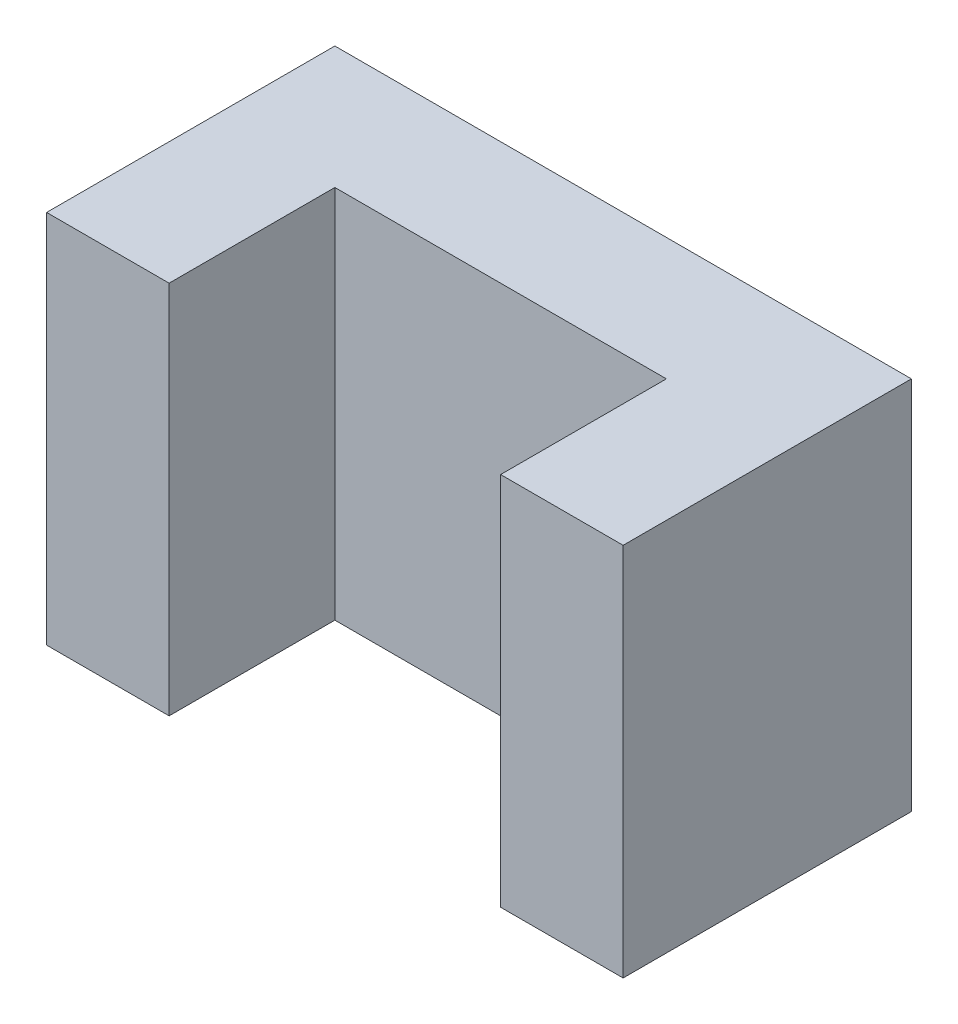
ISO-10303-21;
HEADER;
FILE_DESCRIPTION(('STEP AP214'),'2;1');
FILE_NAME('part.step','',(''),(''),'','','');
FILE_SCHEMA(('AUTOMOTIVE_DESIGN { 1 0 10303 214 1 1 1 1 }'));
ENDSEC;
DATA;
#1=APPLICATION_CONTEXT('core data for automotive mechanical design processes');
#2=APPLICATION_PROTOCOL_DEFINITION('international standard','automotive_design',2000,#1);
#3=PRODUCT_CONTEXT('',#1,'mechanical');
#4=PRODUCT('Part','Part','',(#3));
#5=PRODUCT_RELATED_PRODUCT_CATEGORY('part','',(#4));
#6=PRODUCT_DEFINITION_FORMATION('','',#4);
#7=PRODUCT_DEFINITION_CONTEXT('part definition',#1,'design');
#8=PRODUCT_DEFINITION('design','',#6,#7);
#9=PRODUCT_DEFINITION_SHAPE('','',#8);
#10=(LENGTH_UNIT() NAMED_UNIT(*) SI_UNIT(.MILLI.,.METRE.));
#11=(NAMED_UNIT(*) PLANE_ANGLE_UNIT() SI_UNIT($,.RADIAN.));
#12=(NAMED_UNIT(*) SI_UNIT($,.STERADIAN.) SOLID_ANGLE_UNIT());
#13=UNCERTAINTY_MEASURE_WITH_UNIT(LENGTH_MEASURE(1.E-05),#10,'distance_accuracy_value','');
#14=(GEOMETRIC_REPRESENTATION_CONTEXT(3) GLOBAL_UNCERTAINTY_ASSIGNED_CONTEXT((#13)) GLOBAL_UNIT_ASSIGNED_CONTEXT((#10,
#11,#12)) REPRESENTATION_CONTEXT('',''));
#15=CARTESIAN_POINT('',(0.,0.,0.));
#16=DIRECTION('',(0.,0.,1.));
#17=DIRECTION('',(1.,0.,0.));
#18=AXIS2_PLACEMENT_3D('',#15,#16,#17);
#19=CARTESIAN_POINT('',(-75.4783031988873,0.733936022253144,-20.));
#20=DIRECTION('',(0.,1.,0.));
#21=DIRECTION('',(0.,0.,1.));
#22=AXIS2_PLACEMENT_3D('',#19,#20,#21);
#23=PLANE('',#22);
#24=DIRECTION('',(0.,0.,1.));
#25=VECTOR('',#24,1.);
#26=CARTESIAN_POINT('',(-66.9783031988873,0.733936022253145,-11.5));
#27=LINE('',#26,#25);
#28=CARTESIAN_POINT('',(-66.9783031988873,0.733936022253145,-11.5));
#29=VERTEX_POINT('',#28);
#30=CARTESIAN_POINT('',(-66.9783031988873,0.733936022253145,0.));
#31=VERTEX_POINT('',#30);
#32=EDGE_CURVE('E197',#29,#31,#27,.T.);
#33=ORIENTED_EDGE('',*,*,#32,.F.);
#34=DIRECTION('',(-1.,0.,0.));
#35=VECTOR('',#34,1.);
#36=CARTESIAN_POINT('',(-66.9783031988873,0.733936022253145,-11.5));
#37=LINE('',#36,#35);
#38=CARTESIAN_POINT('',(-43.9783031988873,0.733936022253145,-11.5));
#39=VERTEX_POINT('',#38);
#40=EDGE_CURVE('E132',#39,#29,#37,.T.);
#41=ORIENTED_EDGE('',*,*,#40,.F.);
#42=DIRECTION('',(0.,0.,1.));
#43=VECTOR('',#42,1.);
#44=CARTESIAN_POINT('',(-43.9783031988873,0.733936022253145,-11.5));
#45=LINE('',#44,#43);
#46=CARTESIAN_POINT('',(-43.9783031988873,0.733936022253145,0.));
#47=VERTEX_POINT('',#46);
#48=EDGE_CURVE('E213',#39,#47,#45,.T.);
#49=ORIENTED_EDGE('',*,*,#48,.T.);
#50=DIRECTION('',(-1.,0.,0.));
#51=VECTOR('',#50,1.);
#52=CARTESIAN_POINT('',(-75.4783031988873,0.733936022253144,0.));
#53=LINE('',#52,#51);
#54=CARTESIAN_POINT('',(-35.4783031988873,0.733936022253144,0.));
#55=VERTEX_POINT('',#54);
#56=EDGE_CURVE('E165',#55,#47,#53,.T.);
#57=ORIENTED_EDGE('',*,*,#56,.F.);
#58=DIRECTION('',(0.,0.,1.));
#59=VECTOR('',#58,1.);
#60=CARTESIAN_POINT('',(-35.4783031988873,0.733936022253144,-20.));
#61=LINE('',#60,#59);
#62=CARTESIAN_POINT('',(-35.4783031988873,0.733936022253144,-20.));
#63=VERTEX_POINT('',#62);
#64=EDGE_CURVE('E57',#63,#55,#61,.T.);
#65=ORIENTED_EDGE('',*,*,#64,.F.);
#66=DIRECTION('',(-1.,0.,0.));
#67=VECTOR('',#66,1.);
#68=CARTESIAN_POINT('',(-75.4783031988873,0.733936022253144,-20.));
#69=LINE('',#68,#67);
#70=CARTESIAN_POINT('',(-75.4783031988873,0.733936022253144,-20.));
#71=VERTEX_POINT('',#70);
#72=EDGE_CURVE('E181',#63,#71,#69,.T.);
#73=ORIENTED_EDGE('',*,*,#72,.T.);
#74=DIRECTION('',(0.,0.,1.));
#75=VECTOR('',#74,1.);
#76=CARTESIAN_POINT('',(-75.4783031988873,0.733936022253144,-20.));
#77=LINE('',#76,#75);
#78=CARTESIAN_POINT('',(-75.4783031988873,0.733936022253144,0.));
#79=VERTEX_POINT('',#78);
#80=EDGE_CURVE('E12',#71,#79,#77,.T.);
#81=ORIENTED_EDGE('',*,*,#80,.T.);
#82=EDGE_CURVE('E95',#31,#79,#53,.T.);
#83=ORIENTED_EDGE('',*,*,#82,.F.);
#84=EDGE_LOOP('',(#33,#41,#49,#57,#65,#73,#81,#83));
#85=FACE_BOUND('',#84,.T.);
#86=ADVANCED_FACE('F47',(#85),#23,.T.);
#87=CARTESIAN_POINT('',(-75.4783031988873,-25.2660639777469,-20.));
#88=DIRECTION('',(0.,-1.,0.));
#89=DIRECTION('',(0.,0.,-1.));
#90=AXIS2_PLACEMENT_3D('',#87,#88,#89);
#91=PLANE('',#90);
#92=DIRECTION('',(0.,0.,1.));
#93=VECTOR('',#92,1.);
#94=CARTESIAN_POINT('',(-66.9783031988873,-25.2660639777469,-11.5));
#95=LINE('',#94,#93);
#96=CARTESIAN_POINT('',(-66.9783031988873,-25.2660639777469,-11.5));
#97=VERTEX_POINT('',#96);
#98=CARTESIAN_POINT('',(-66.9783031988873,-25.2660639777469,0.));
#99=VERTEX_POINT('',#98);
#100=EDGE_CURVE('E123',#97,#99,#95,.T.);
#101=ORIENTED_EDGE('',*,*,#100,.T.);
#102=DIRECTION('',(1.,0.,0.));
#103=VECTOR('',#102,1.);
#104=CARTESIAN_POINT('',(-75.4783031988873,-25.2660639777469,0.));
#105=LINE('',#104,#103);
#106=CARTESIAN_POINT('',(-75.4783031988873,-25.2660639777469,0.));
#107=VERTEX_POINT('',#106);
#108=EDGE_CURVE('E198',#107,#99,#105,.T.);
#109=ORIENTED_EDGE('',*,*,#108,.F.);
#110=DIRECTION('',(0.,0.,1.));
#111=VECTOR('',#110,1.);
#112=CARTESIAN_POINT('',(-75.4783031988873,-25.2660639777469,-20.));
#113=LINE('',#112,#111);
#114=CARTESIAN_POINT('',(-75.4783031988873,-25.2660639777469,-20.));
#115=VERTEX_POINT('',#114);
#116=EDGE_CURVE('E51',#115,#107,#113,.T.);
#117=ORIENTED_EDGE('',*,*,#116,.F.);
#118=DIRECTION('',(1.,0.,0.));
#119=VECTOR('',#118,1.);
#120=CARTESIAN_POINT('',(-75.4783031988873,-25.2660639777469,-20.));
#121=LINE('',#120,#119);
#122=CARTESIAN_POINT('',(-35.4783031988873,-25.2660639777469,-20.));
#123=VERTEX_POINT('',#122);
#124=EDGE_CURVE('E190',#115,#123,#121,.T.);
#125=ORIENTED_EDGE('',*,*,#124,.T.);
#126=DIRECTION('',(0.,0.,1.));
#127=VECTOR('',#126,1.);
#128=CARTESIAN_POINT('',(-35.4783031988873,-25.2660639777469,-20.));
#129=LINE('',#128,#127);
#130=CARTESIAN_POINT('',(-35.4783031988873,-25.2660639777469,0.));
#131=VERTEX_POINT('',#130);
#132=EDGE_CURVE('E176',#123,#131,#129,.T.);
#133=ORIENTED_EDGE('',*,*,#132,.T.);
#134=CARTESIAN_POINT('',(-43.9783031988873,-25.2660639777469,0.));
#135=VERTEX_POINT('',#134);
#136=EDGE_CURVE('E196',#135,#131,#105,.T.);
#137=ORIENTED_EDGE('',*,*,#136,.F.);
#138=DIRECTION('',(0.,0.,1.));
#139=VECTOR('',#138,1.);
#140=CARTESIAN_POINT('',(-43.9783031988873,-25.2660639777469,-11.5));
#141=LINE('',#140,#139);
#142=CARTESIAN_POINT('',(-43.9783031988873,-25.2660639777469,-11.5));
#143=VERTEX_POINT('',#142);
#144=EDGE_CURVE('E65',#143,#135,#141,.T.);
#145=ORIENTED_EDGE('',*,*,#144,.F.);
#146=DIRECTION('',(1.,0.,0.));
#147=VECTOR('',#146,1.);
#148=CARTESIAN_POINT('',(-66.9783031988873,-25.2660639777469,-11.5));
#149=LINE('',#148,#147);
#150=EDGE_CURVE('E138',#97,#143,#149,.T.);
#151=ORIENTED_EDGE('',*,*,#150,.F.);
#152=EDGE_LOOP('',(#101,#109,#117,#125,#133,#137,#145,#151));
#153=FACE_BOUND('',#152,.T.);
#154=ADVANCED_FACE('F144',(#153),#91,.T.);
#155=CARTESIAN_POINT('',(-75.4783031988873,-25.2660639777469,0.));
#156=DIRECTION('',(0.,0.,1.));
#157=DIRECTION('',(1.,0.,0.));
#158=AXIS2_PLACEMENT_3D('',#155,#156,#157);
#159=PLANE('',#158);
#160=DIRECTION('',(0.,-1.,0.));
#161=VECTOR('',#160,1.);
#162=CARTESIAN_POINT('',(-66.9783031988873,0.733936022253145,0.));
#163=LINE('',#162,#161);
#164=EDGE_CURVE('E128',#31,#99,#163,.T.);
#165=ORIENTED_EDGE('',*,*,#164,.F.);
#166=ORIENTED_EDGE('',*,*,#82,.T.);
#167=DIRECTION('',(0.,-1.,0.));
#168=VECTOR('',#167,1.);
#169=CARTESIAN_POINT('',(-75.4783031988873,0.733936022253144,0.));
#170=LINE('',#169,#168);
#171=EDGE_CURVE('E193',#79,#107,#170,.T.);
#172=ORIENTED_EDGE('',*,*,#171,.T.);
#173=ORIENTED_EDGE('',*,*,#108,.T.);
#174=EDGE_LOOP('',(#165,#166,#172,#173));
#175=FACE_BOUND('',#174,.T.);
#176=ADVANCED_FACE('F233',(#175),#159,.T.);
#177=DIRECTION('',(0.,1.,0.));
#178=VECTOR('',#177,1.);
#179=CARTESIAN_POINT('',(-43.9783031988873,0.733936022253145,0.));
#180=LINE('',#179,#178);
#181=EDGE_CURVE('E142',#135,#47,#180,.T.);
#182=ORIENTED_EDGE('',*,*,#181,.F.);
#183=ORIENTED_EDGE('',*,*,#136,.T.);
#184=DIRECTION('',(0.,1.,0.));
#185=VECTOR('',#184,1.);
#186=CARTESIAN_POINT('',(-35.4783031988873,0.733936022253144,0.));
#187=LINE('',#186,#185);
#188=EDGE_CURVE('E171',#131,#55,#187,.T.);
#189=ORIENTED_EDGE('',*,*,#188,.T.);
#190=ORIENTED_EDGE('',*,*,#56,.T.);
#191=EDGE_LOOP('',(#182,#183,#189,#190));
#192=FACE_BOUND('',#191,.T.);
#193=ADVANCED_FACE('F208',(#192),#159,.T.);
#194=CARTESIAN_POINT('',(-75.4783031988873,0.733936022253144,-20.));
#195=DIRECTION('',(-1.,0.,0.));
#196=DIRECTION('',(0.,0.,1.));
#197=AXIS2_PLACEMENT_3D('',#194,#195,#196);
#198=PLANE('',#197);
#199=ORIENTED_EDGE('',*,*,#171,.F.);
#200=ORIENTED_EDGE('',*,*,#80,.F.);
#201=DIRECTION('',(0.,-1.,0.));
#202=VECTOR('',#201,1.);
#203=CARTESIAN_POINT('',(-75.4783031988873,0.733936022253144,-20.));
#204=LINE('',#203,#202);
#205=EDGE_CURVE('E170',#71,#115,#204,.T.);
#206=ORIENTED_EDGE('',*,*,#205,.T.);
#207=ORIENTED_EDGE('',*,*,#116,.T.);
#208=EDGE_LOOP('',(#199,#200,#206,#207));
#209=FACE_BOUND('',#208,.T.);
#210=ADVANCED_FACE('F49',(#209),#198,.T.);
#211=CARTESIAN_POINT('',(-35.4783031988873,0.733936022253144,-20.));
#212=DIRECTION('',(1.,0.,0.));
#213=DIRECTION('',(0.,0.,-1.));
#214=AXIS2_PLACEMENT_3D('',#211,#212,#213);
#215=PLANE('',#214);
#216=ORIENTED_EDGE('',*,*,#188,.F.);
#217=ORIENTED_EDGE('',*,*,#132,.F.);
#218=DIRECTION('',(0.,1.,0.));
#219=VECTOR('',#218,1.);
#220=CARTESIAN_POINT('',(-35.4783031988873,0.733936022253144,-20.));
#221=LINE('',#220,#219);
#222=EDGE_CURVE('E184',#123,#63,#221,.T.);
#223=ORIENTED_EDGE('',*,*,#222,.T.);
#224=ORIENTED_EDGE('',*,*,#64,.T.);
#225=EDGE_LOOP('',(#216,#217,#223,#224));
#226=FACE_BOUND('',#225,.T.);
#227=ADVANCED_FACE('F226',(#226),#215,.T.);
#228=CARTESIAN_POINT('',(-75.4783031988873,-25.2660639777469,-20.));
#229=DIRECTION('',(0.,0.,1.));
#230=DIRECTION('',(1.,0.,0.));
#231=AXIS2_PLACEMENT_3D('',#228,#229,#230);
#232=PLANE('',#231);
#233=ORIENTED_EDGE('',*,*,#205,.F.);
#234=ORIENTED_EDGE('',*,*,#72,.F.);
#235=ORIENTED_EDGE('',*,*,#222,.F.);
#236=ORIENTED_EDGE('',*,*,#124,.F.);
#237=EDGE_LOOP('',(#233,#234,#235,#236));
#238=FACE_BOUND('',#237,.T.);
#239=ADVANCED_FACE('F224',(#238),#232,.F.);
#240=CARTESIAN_POINT('',(-66.9783031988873,0.733936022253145,-11.5));
#241=DIRECTION('',(-1.,0.,0.));
#242=DIRECTION('',(0.,0.,1.));
#243=AXIS2_PLACEMENT_3D('',#240,#241,#242);
#244=PLANE('',#243);
#245=ORIENTED_EDGE('',*,*,#164,.T.);
#246=ORIENTED_EDGE('',*,*,#100,.F.);
#247=DIRECTION('',(0.,-1.,0.));
#248=VECTOR('',#247,1.);
#249=CARTESIAN_POINT('',(-66.9783031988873,0.733936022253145,-11.5));
#250=LINE('',#249,#248);
#251=EDGE_CURVE('E126',#29,#97,#250,.T.);
#252=ORIENTED_EDGE('',*,*,#251,.F.);
#253=ORIENTED_EDGE('',*,*,#32,.T.);
#254=EDGE_LOOP('',(#245,#246,#252,#253));
#255=FACE_BOUND('',#254,.T.);
#256=ADVANCED_FACE('F125',(#255),#244,.F.);
#257=CARTESIAN_POINT('',(-43.9783031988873,0.733936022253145,-11.5));
#258=DIRECTION('',(1.,0.,0.));
#259=DIRECTION('',(0.,0.,-1.));
#260=AXIS2_PLACEMENT_3D('',#257,#258,#259);
#261=PLANE('',#260);
#262=ORIENTED_EDGE('',*,*,#181,.T.);
#263=ORIENTED_EDGE('',*,*,#48,.F.);
#264=DIRECTION('',(0.,1.,0.));
#265=VECTOR('',#264,1.);
#266=CARTESIAN_POINT('',(-43.9783031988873,0.733936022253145,-11.5));
#267=LINE('',#266,#265);
#268=EDGE_CURVE('E147',#143,#39,#267,.T.);
#269=ORIENTED_EDGE('',*,*,#268,.F.);
#270=ORIENTED_EDGE('',*,*,#144,.T.);
#271=EDGE_LOOP('',(#262,#263,#269,#270));
#272=FACE_BOUND('',#271,.T.);
#273=ADVANCED_FACE('F212',(#272),#261,.F.);
#274=CARTESIAN_POINT('',(-66.9783031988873,-25.2660639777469,-11.5));
#275=DIRECTION('',(0.,0.,1.));
#276=DIRECTION('',(1.,0.,0.));
#277=AXIS2_PLACEMENT_3D('',#274,#275,#276);
#278=PLANE('',#277);
#279=ORIENTED_EDGE('',*,*,#251,.T.);
#280=ORIENTED_EDGE('',*,*,#150,.T.);
#281=ORIENTED_EDGE('',*,*,#268,.T.);
#282=ORIENTED_EDGE('',*,*,#40,.T.);
#283=EDGE_LOOP('',(#279,#280,#281,#282));
#284=FACE_BOUND('',#283,.T.);
#285=ADVANCED_FACE('F136',(#284),#278,.T.);
#286=CLOSED_SHELL('',(#86,#154,#176,#193,#210,#227,#239,#256,#273,#285));
#287=MANIFOLD_SOLID_BREP('B2',#286);
#288=ADVANCED_BREP_SHAPE_REPRESENTATION('',(#18,#287),#14);
#289=SHAPE_DEFINITION_REPRESENTATION(#9,#288);
ENDSEC;
END-ISO-10303-21;
